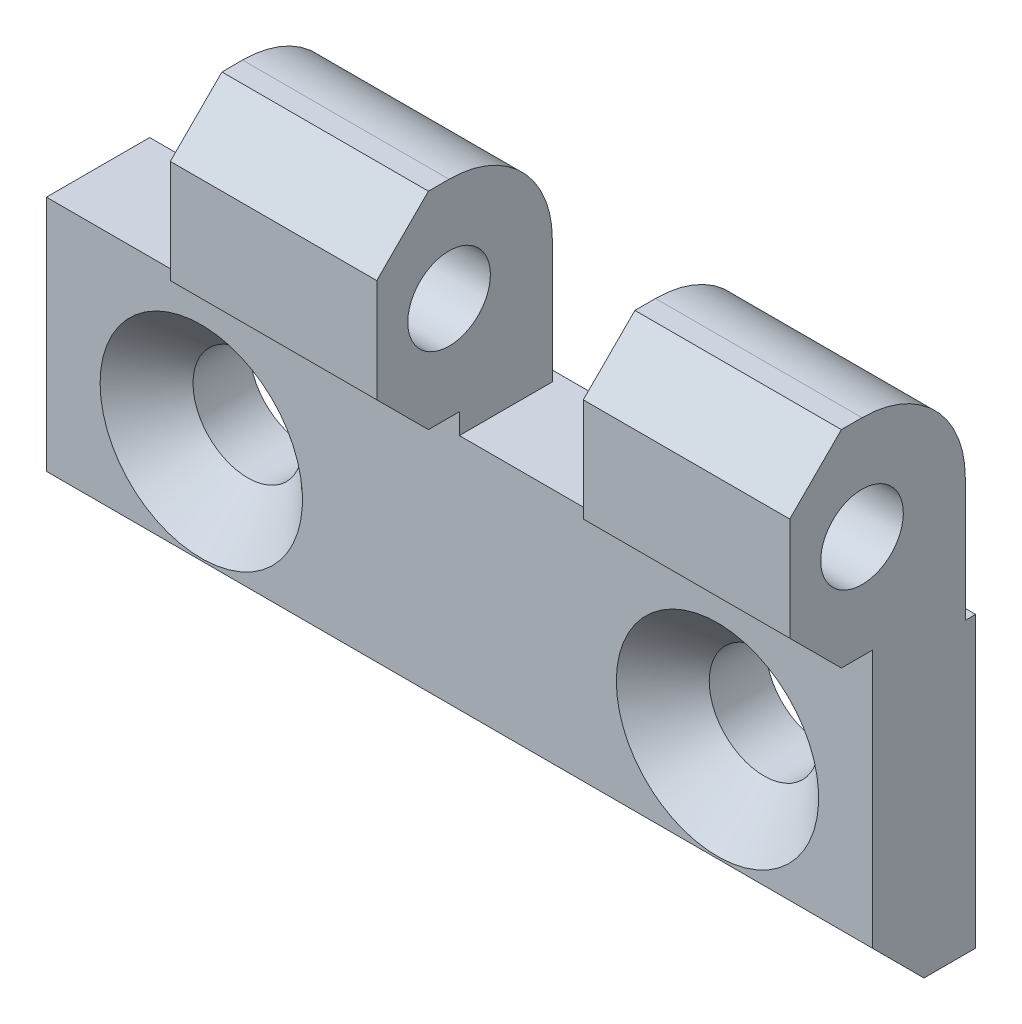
ISO-10303-21;
HEADER;
FILE_DESCRIPTION(('STEP AP214'),'2;1');
FILE_NAME('part.step','',(''),(''),'','','');
FILE_SCHEMA(('AUTOMOTIVE_DESIGN { 1 0 10303 214 1 1 1 1 }'));
ENDSEC;
DATA;
#1=APPLICATION_CONTEXT('core data for automotive mechanical design processes');
#2=APPLICATION_PROTOCOL_DEFINITION('international standard','automotive_design',2000,#1);
#3=PRODUCT_CONTEXT('',#1,'mechanical');
#4=PRODUCT('Part','Part','',(#3));
#5=PRODUCT_RELATED_PRODUCT_CATEGORY('part','',(#4));
#6=PRODUCT_DEFINITION_FORMATION('','',#4);
#7=PRODUCT_DEFINITION_CONTEXT('part definition',#1,'design');
#8=PRODUCT_DEFINITION('design','',#6,#7);
#9=PRODUCT_DEFINITION_SHAPE('','',#8);
#10=(LENGTH_UNIT() NAMED_UNIT(*) SI_UNIT(.MILLI.,.METRE.));
#11=(NAMED_UNIT(*) PLANE_ANGLE_UNIT() SI_UNIT($,.RADIAN.));
#12=(NAMED_UNIT(*) SI_UNIT($,.STERADIAN.) SOLID_ANGLE_UNIT());
#13=UNCERTAINTY_MEASURE_WITH_UNIT(LENGTH_MEASURE(1.E-05),#10,'distance_accuracy_value','');
#14=(GEOMETRIC_REPRESENTATION_CONTEXT(3) GLOBAL_UNCERTAINTY_ASSIGNED_CONTEXT((#13)) GLOBAL_UNIT_ASSIGNED_CONTEXT((#10,
#11,#12)) REPRESENTATION_CONTEXT('',''));
#15=CARTESIAN_POINT('',(0.,0.,0.));
#16=DIRECTION('',(0.,0.,1.));
#17=DIRECTION('',(1.,0.,0.));
#18=AXIS2_PLACEMENT_3D('',#15,#16,#17);
#19=CARTESIAN_POINT('',(-7.5,12.5,5.5));
#20=DIRECTION('',(1.,0.,0.));
#21=DIRECTION('',(0.,1.,0.));
#22=AXIS2_PLACEMENT_3D('',#19,#20,#21);
#23=CYLINDRICAL_SURFACE('',#22,5.);
#24=DIRECTION('',(1.,0.,0.));
#25=VECTOR('',#24,1.);
#26=CARTESIAN_POINT('',(-7.5,12.5,0.5));
#27=LINE('',#26,#25);
#28=CARTESIAN_POINT('',(22.5,12.5,0.5));
#29=VERTEX_POINT('',#28);
#30=CARTESIAN_POINT('',(32.5,12.5,0.5));
#31=VERTEX_POINT('',#30);
#32=EDGE_CURVE('E189',#29,#31,#27,.T.);
#33=ORIENTED_EDGE('',*,*,#32,.F.);
#34=CARTESIAN_POINT('',(22.5,12.5,5.5));
#35=DIRECTION('',(-1.,0.,0.));
#36=DIRECTION('',(0.,-1.,0.));
#37=AXIS2_PLACEMENT_3D('',#34,#35,#36);
#38=CIRCLE('',#37,5.);
#39=CARTESIAN_POINT('',(22.5,17.5,5.5));
#40=VERTEX_POINT('',#39);
#41=EDGE_CURVE('E286',#29,#40,#38,.F.);
#42=ORIENTED_EDGE('',*,*,#41,.T.);
#43=DIRECTION('',(1.,0.,0.));
#44=VECTOR('',#43,1.);
#45=CARTESIAN_POINT('',(-7.5,17.5,5.5));
#46=LINE('',#45,#44);
#47=CARTESIAN_POINT('',(32.5,17.5,5.5));
#48=VERTEX_POINT('',#47);
#49=EDGE_CURVE('E336',#40,#48,#46,.T.);
#50=ORIENTED_EDGE('',*,*,#49,.T.);
#51=CARTESIAN_POINT('',(32.5,12.5,5.5));
#52=DIRECTION('',(1.,0.,0.));
#53=DIRECTION('',(0.,1.,0.));
#54=AXIS2_PLACEMENT_3D('',#51,#52,#53);
#55=CIRCLE('',#54,5.);
#56=EDGE_CURVE('E298',#31,#48,#55,.T.);
#57=ORIENTED_EDGE('',*,*,#56,.F.);
#58=EDGE_LOOP('',(#33,#42,#50,#57));
#59=FACE_BOUND('',#58,.T.);
#60=ADVANCED_FACE('F14',(#59),#23,.T.);
#61=CARTESIAN_POINT('',(12.5,12.5,5.5));
#62=DIRECTION('',(-1.,0.,0.));
#63=DIRECTION('',(0.,-1.,0.));
#64=AXIS2_PLACEMENT_3D('',#61,#62,#63);
#65=CIRCLE('',#64,5.);
#66=CARTESIAN_POINT('',(12.5,12.5,0.5));
#67=VERTEX_POINT('',#66);
#68=CARTESIAN_POINT('',(12.5,17.5,5.5));
#69=VERTEX_POINT('',#68);
#70=EDGE_CURVE('E363',#67,#69,#65,.F.);
#71=ORIENTED_EDGE('',*,*,#70,.F.);
#72=CARTESIAN_POINT('',(2.5,12.5,0.5));
#73=VERTEX_POINT('',#72);
#74=EDGE_CURVE('E192',#73,#67,#27,.T.);
#75=ORIENTED_EDGE('',*,*,#74,.F.);
#76=CARTESIAN_POINT('',(2.5,12.5,5.5));
#77=DIRECTION('',(-1.,0.,0.));
#78=DIRECTION('',(0.,-1.,0.));
#79=AXIS2_PLACEMENT_3D('',#76,#77,#78);
#80=CIRCLE('',#79,5.);
#81=CARTESIAN_POINT('',(2.5,17.5,5.5));
#82=VERTEX_POINT('',#81);
#83=EDGE_CURVE('E169',#73,#82,#80,.F.);
#84=ORIENTED_EDGE('',*,*,#83,.T.);
#85=EDGE_CURVE('E338',#82,#69,#46,.T.);
#86=ORIENTED_EDGE('',*,*,#85,.T.);
#87=EDGE_LOOP('',(#71,#75,#84,#86));
#88=FACE_BOUND('',#87,.T.);
#89=ADVANCED_FACE('F432',(#88),#23,.T.);
#90=CARTESIAN_POINT('',(-7.5,12.5,0.5));
#91=DIRECTION('',(0.,0.,1.));
#92=DIRECTION('',(0.,-1.,0.));
#93=AXIS2_PLACEMENT_3D('',#90,#91,#92);
#94=PLANE('',#93);
#95=DIRECTION('',(0.,-1.,0.));
#96=VECTOR('',#95,1.);
#97=CARTESIAN_POINT('',(22.5,12.5,0.5));
#98=LINE('',#97,#96);
#99=CARTESIAN_POINT('',(22.5,6.5,0.5));
#100=VERTEX_POINT('',#99);
#101=EDGE_CURVE('E289',#29,#100,#98,.T.);
#102=ORIENTED_EDGE('',*,*,#101,.F.);
#103=ORIENTED_EDGE('',*,*,#32,.T.);
#104=DIRECTION('',(0.,-1.,0.));
#105=VECTOR('',#104,1.);
#106=CARTESIAN_POINT('',(32.5,12.5,0.5));
#107=LINE('',#106,#105);
#108=CARTESIAN_POINT('',(32.5,6.5,0.5));
#109=VERTEX_POINT('',#108);
#110=EDGE_CURVE('E321',#31,#109,#107,.T.);
#111=ORIENTED_EDGE('',*,*,#110,.T.);
#112=DIRECTION('',(1.,0.,0.));
#113=VECTOR('',#112,1.);
#114=CARTESIAN_POINT('',(-7.5,6.5,0.5));
#115=LINE('',#114,#113);
#116=EDGE_CURVE('E190',#100,#109,#115,.T.);
#117=ORIENTED_EDGE('',*,*,#116,.F.);
#118=EDGE_LOOP('',(#102,#103,#111,#117));
#119=FACE_BOUND('',#118,.T.);
#120=ADVANCED_FACE('F16',(#119),#94,.F.);
#121=ORIENTED_EDGE('',*,*,#74,.T.);
#122=DIRECTION('',(0.,-1.,0.));
#123=VECTOR('',#122,1.);
#124=CARTESIAN_POINT('',(12.5,12.5,0.5));
#125=LINE('',#124,#123);
#126=CARTESIAN_POINT('',(12.5,6.5,0.5));
#127=VERTEX_POINT('',#126);
#128=EDGE_CURVE('E188',#67,#127,#125,.T.);
#129=ORIENTED_EDGE('',*,*,#128,.T.);
#130=CARTESIAN_POINT('',(2.5,6.5,0.5));
#131=VERTEX_POINT('',#130);
#132=EDGE_CURVE('E180',#131,#127,#115,.T.);
#133=ORIENTED_EDGE('',*,*,#132,.F.);
#134=DIRECTION('',(0.,-1.,0.));
#135=VECTOR('',#134,1.);
#136=CARTESIAN_POINT('',(2.5,12.5,0.5));
#137=LINE('',#136,#135);
#138=EDGE_CURVE('E162',#73,#131,#137,.T.);
#139=ORIENTED_EDGE('',*,*,#138,.F.);
#140=EDGE_LOOP('',(#121,#129,#133,#139));
#141=FACE_BOUND('',#140,.T.);
#142=ADVANCED_FACE('F187',(#141),#94,.F.);
#143=CARTESIAN_POINT('',(-7.5,-7.5,5.));
#144=DIRECTION('',(0.,0.,-1.));
#145=DIRECTION('',(-1.,0.,0.));
#146=AXIS2_PLACEMENT_3D('',#143,#144,#145);
#147=PLANE('',#146);
#148=CARTESIAN_POINT('',(25.,0.,5.));
#149=DIRECTION('',(0.,0.,-1.));
#150=DIRECTION('',(-1.,0.,0.));
#151=AXIS2_PLACEMENT_3D('',#148,#149,#150);
#152=CIRCLE('',#151,4.9);
#153=CARTESIAN_POINT('',(20.1,0.,5.));
#154=VERTEX_POINT('',#153);
#155=EDGE_CURVE('E243',#154,#154,#152,.T.);
#156=ORIENTED_EDGE('',*,*,#155,.T.);
#157=EDGE_LOOP('',(#156));
#158=FACE_BOUND('',#157,.T.);
#159=CARTESIAN_POINT('',(0.,0.,5.));
#160=DIRECTION('',(0.,0.,-1.));
#161=DIRECTION('',(-1.,0.,0.));
#162=AXIS2_PLACEMENT_3D('',#159,#160,#161);
#163=CIRCLE('',#162,4.9);
#164=CARTESIAN_POINT('',(-4.9,0.,5.));
#165=VERTEX_POINT('',#164);
#166=EDGE_CURVE('E235',#165,#165,#163,.T.);
#167=ORIENTED_EDGE('',*,*,#166,.T.);
#168=EDGE_LOOP('',(#167));
#169=FACE_BOUND('',#168,.T.);
#170=DIRECTION('',(0.,1.,0.));
#171=VECTOR('',#170,1.);
#172=CARTESIAN_POINT('',(22.5,-7.5,5.));
#173=LINE('',#172,#171);
#174=CARTESIAN_POINT('',(22.5,6.5,5.));
#175=VERTEX_POINT('',#174);
#176=CARTESIAN_POINT('',(22.5,7.5,5.));
#177=VERTEX_POINT('',#176);
#178=EDGE_CURVE('E268',#175,#177,#173,.T.);
#179=ORIENTED_EDGE('',*,*,#178,.F.);
#180=DIRECTION('',(-1.,0.,0.));
#181=VECTOR('',#180,1.);
#182=CARTESIAN_POINT('',(-7.5,6.5,5.));
#183=LINE('',#182,#181);
#184=CARTESIAN_POINT('',(12.5,6.5,5.));
#185=VERTEX_POINT('',#184);
#186=EDGE_CURVE('E232',#175,#185,#183,.T.);
#187=ORIENTED_EDGE('',*,*,#186,.T.);
#188=DIRECTION('',(0.,1.,0.));
#189=VECTOR('',#188,1.);
#190=CARTESIAN_POINT('',(12.5,-7.5,5.));
#191=LINE('',#190,#189);
#192=CARTESIAN_POINT('',(12.5,7.5,5.));
#193=VERTEX_POINT('',#192);
#194=EDGE_CURVE('E353',#185,#193,#191,.T.);
#195=ORIENTED_EDGE('',*,*,#194,.T.);
#196=DIRECTION('',(1.,0.,0.));
#197=VECTOR('',#196,1.);
#198=CARTESIAN_POINT('',(-7.5,7.5,5.));
#199=LINE('',#198,#197);
#200=CARTESIAN_POINT('',(2.5,7.5,5.));
#201=VERTEX_POINT('',#200);
#202=EDGE_CURVE('E339',#201,#193,#199,.T.);
#203=ORIENTED_EDGE('',*,*,#202,.F.);
#204=DIRECTION('',(0.,1.,0.));
#205=VECTOR('',#204,1.);
#206=CARTESIAN_POINT('',(2.5,-7.5,5.));
#207=LINE('',#206,#205);
#208=CARTESIAN_POINT('',(2.5,6.5,5.));
#209=VERTEX_POINT('',#208);
#210=EDGE_CURVE('E352',#209,#201,#207,.T.);
#211=ORIENTED_EDGE('',*,*,#210,.F.);
#212=DIRECTION('',(-1.,0.,0.));
#213=VECTOR('',#212,1.);
#214=CARTESIAN_POINT('',(-7.5,6.5,5.));
#215=LINE('',#214,#213);
#216=CARTESIAN_POINT('',(-7.5,6.5,5.));
#217=VERTEX_POINT('',#216);
#218=EDGE_CURVE('E182',#209,#217,#215,.T.);
#219=ORIENTED_EDGE('',*,*,#218,.T.);
#220=DIRECTION('',(0.,1.,0.));
#221=VECTOR('',#220,1.);
#222=CARTESIAN_POINT('',(-7.5,-7.5,5.));
#223=LINE('',#222,#221);
#224=CARTESIAN_POINT('',(-7.5,-5.,5.));
#225=VERTEX_POINT('',#224);
#226=EDGE_CURVE('E324',#225,#217,#223,.T.);
#227=ORIENTED_EDGE('',*,*,#226,.F.);
#228=DIRECTION('',(1.,0.,0.));
#229=VECTOR('',#228,1.);
#230=CARTESIAN_POINT('',(-7.5,-5.,5.));
#231=LINE('',#230,#229);
#232=CARTESIAN_POINT('',(32.5,-5.,5.));
#233=VERTEX_POINT('',#232);
#234=EDGE_CURVE('E220',#225,#233,#231,.T.);
#235=ORIENTED_EDGE('',*,*,#234,.T.);
#236=DIRECTION('',(0.,1.,0.));
#237=VECTOR('',#236,1.);
#238=CARTESIAN_POINT('',(32.5,-7.5,5.));
#239=LINE('',#238,#237);
#240=CARTESIAN_POINT('',(32.5,7.5,5.));
#241=VERTEX_POINT('',#240);
#242=EDGE_CURVE('E310',#233,#241,#239,.T.);
#243=ORIENTED_EDGE('',*,*,#242,.T.);
#244=EDGE_CURVE('E271',#177,#241,#199,.T.);
#245=ORIENTED_EDGE('',*,*,#244,.F.);
#246=EDGE_LOOP('',(#179,#187,#195,#203,#211,#219,#227,#235,#243,#245));
#247=FACE_BOUND('',#246,.T.);
#248=ADVANCED_FACE('F259',(#158,#169,#247),#147,.F.);
#249=CARTESIAN_POINT('',(-7.5,7.5,9.));
#250=DIRECTION('',(0.,-1.,0.));
#251=DIRECTION('',(0.,0.,-1.));
#252=AXIS2_PLACEMENT_3D('',#249,#250,#251);
#253=PLANE('',#252);
#254=DIRECTION('',(-1.,0.,0.));
#255=VECTOR('',#254,1.);
#256=CARTESIAN_POINT('',(-7.5,7.5,6.5));
#257=LINE('',#256,#255);
#258=CARTESIAN_POINT('',(32.5,7.5,6.5));
#259=VERTEX_POINT('',#258);
#260=CARTESIAN_POINT('',(22.5,7.5,6.5));
#261=VERTEX_POINT('',#260);
#262=EDGE_CURVE('E217',#259,#261,#257,.T.);
#263=ORIENTED_EDGE('',*,*,#262,.T.);
#264=DIRECTION('',(0.,0.,-1.));
#265=VECTOR('',#264,1.);
#266=CARTESIAN_POINT('',(22.5,7.5,9.));
#267=LINE('',#266,#265);
#268=EDGE_CURVE('E276',#261,#177,#267,.T.);
#269=ORIENTED_EDGE('',*,*,#268,.T.);
#270=ORIENTED_EDGE('',*,*,#244,.T.);
#271=DIRECTION('',(0.,0.,-1.));
#272=VECTOR('',#271,1.);
#273=CARTESIAN_POINT('',(32.5,7.5,9.));
#274=LINE('',#273,#272);
#275=EDGE_CURVE('E307',#259,#241,#274,.T.);
#276=ORIENTED_EDGE('',*,*,#275,.F.);
#277=EDGE_LOOP('',(#263,#269,#270,#276));
#278=FACE_BOUND('',#277,.T.);
#279=ADVANCED_FACE('F262',(#278),#253,.T.);
#280=DIRECTION('',(0.,0.,-1.));
#281=VECTOR('',#280,1.);
#282=CARTESIAN_POINT('',(12.5,7.5,9.));
#283=LINE('',#282,#281);
#284=CARTESIAN_POINT('',(12.5,7.5,6.5));
#285=VERTEX_POINT('',#284);
#286=EDGE_CURVE('E350',#285,#193,#283,.T.);
#287=ORIENTED_EDGE('',*,*,#286,.F.);
#288=CARTESIAN_POINT('',(2.5,7.5,6.5));
#289=VERTEX_POINT('',#288);
#290=EDGE_CURVE('E216',#285,#289,#257,.T.);
#291=ORIENTED_EDGE('',*,*,#290,.T.);
#292=DIRECTION('',(0.,0.,-1.));
#293=VECTOR('',#292,1.);
#294=CARTESIAN_POINT('',(2.5,7.5,9.));
#295=LINE('',#294,#293);
#296=EDGE_CURVE('E37',#289,#201,#295,.T.);
#297=ORIENTED_EDGE('',*,*,#296,.T.);
#298=ORIENTED_EDGE('',*,*,#202,.T.);
#299=EDGE_LOOP('',(#287,#291,#297,#298));
#300=FACE_BOUND('',#299,.T.);
#301=ADVANCED_FACE('F348',(#300),#253,.T.);
#302=CARTESIAN_POINT('',(-7.5,7.5,9.));
#303=DIRECTION('',(0.,0.,-1.));
#304=DIRECTION('',(0.,1.,0.));
#305=AXIS2_PLACEMENT_3D('',#302,#303,#304);
#306=PLANE('',#305);
#307=DIRECTION('',(0.,1.,0.));
#308=VECTOR('',#307,1.);
#309=CARTESIAN_POINT('',(22.5,7.5,9.));
#310=LINE('',#309,#308);
#311=CARTESIAN_POINT('',(22.5,10.,9.));
#312=VERTEX_POINT('',#311);
#313=CARTESIAN_POINT('',(22.5,15.,9.));
#314=VERTEX_POINT('',#313);
#315=EDGE_CURVE('E281',#312,#314,#310,.T.);
#316=ORIENTED_EDGE('',*,*,#315,.F.);
#317=DIRECTION('',(1.,0.,0.));
#318=VECTOR('',#317,1.);
#319=CARTESIAN_POINT('',(32.5,10.,9.));
#320=LINE('',#319,#318);
#321=CARTESIAN_POINT('',(32.5,10.,9.));
#322=VERTEX_POINT('',#321);
#323=EDGE_CURVE('E207',#312,#322,#320,.T.);
#324=ORIENTED_EDGE('',*,*,#323,.T.);
#325=DIRECTION('',(0.,1.,0.));
#326=VECTOR('',#325,1.);
#327=CARTESIAN_POINT('',(32.5,7.5,9.));
#328=LINE('',#327,#326);
#329=CARTESIAN_POINT('',(32.5,15.,9.));
#330=VERTEX_POINT('',#329);
#331=EDGE_CURVE('E304',#322,#330,#328,.T.);
#332=ORIENTED_EDGE('',*,*,#331,.T.);
#333=DIRECTION('',(-1.,0.,0.));
#334=VECTOR('',#333,1.);
#335=CARTESIAN_POINT('',(-7.5,15.,9.));
#336=LINE('',#335,#334);
#337=EDGE_CURVE('E210',#330,#314,#336,.T.);
#338=ORIENTED_EDGE('',*,*,#337,.T.);
#339=EDGE_LOOP('',(#316,#324,#332,#338));
#340=FACE_BOUND('',#339,.T.);
#341=ADVANCED_FACE('F379',(#340),#306,.F.);
#342=CARTESIAN_POINT('',(2.5,10.,9.));
#343=VERTEX_POINT('',#342);
#344=CARTESIAN_POINT('',(12.5,10.,9.));
#345=VERTEX_POINT('',#344);
#346=EDGE_CURVE('E209',#343,#345,#320,.T.);
#347=ORIENTED_EDGE('',*,*,#346,.T.);
#348=DIRECTION('',(0.,1.,0.));
#349=VECTOR('',#348,1.);
#350=CARTESIAN_POINT('',(12.5,7.5,9.));
#351=LINE('',#350,#349);
#352=CARTESIAN_POINT('',(12.5,15.,9.));
#353=VERTEX_POINT('',#352);
#354=EDGE_CURVE('E29',#345,#353,#351,.T.);
#355=ORIENTED_EDGE('',*,*,#354,.T.);
#356=CARTESIAN_POINT('',(2.5,15.,9.));
#357=VERTEX_POINT('',#356);
#358=EDGE_CURVE('E214',#353,#357,#336,.T.);
#359=ORIENTED_EDGE('',*,*,#358,.T.);
#360=DIRECTION('',(0.,1.,0.));
#361=VECTOR('',#360,1.);
#362=CARTESIAN_POINT('',(2.5,7.5,9.));
#363=LINE('',#362,#361);
#364=EDGE_CURVE('E399',#343,#357,#363,.T.);
#365=ORIENTED_EDGE('',*,*,#364,.F.);
#366=EDGE_LOOP('',(#347,#355,#359,#365));
#367=FACE_BOUND('',#366,.T.);
#368=ADVANCED_FACE('F417',(#367),#306,.F.);
#369=CARTESIAN_POINT('',(-7.5,17.5,9.));
#370=DIRECTION('',(0.,-1.,0.));
#371=DIRECTION('',(0.,0.,-1.));
#372=AXIS2_PLACEMENT_3D('',#369,#370,#371);
#373=PLANE('',#372);
#374=DIRECTION('',(0.,0.,-1.));
#375=VECTOR('',#374,1.);
#376=CARTESIAN_POINT('',(22.5,17.5,9.));
#377=LINE('',#376,#375);
#378=CARTESIAN_POINT('',(22.5,17.5,6.5));
#379=VERTEX_POINT('',#378);
#380=EDGE_CURVE('E279',#379,#40,#377,.T.);
#381=ORIENTED_EDGE('',*,*,#380,.F.);
#382=DIRECTION('',(1.,0.,0.));
#383=VECTOR('',#382,1.);
#384=CARTESIAN_POINT('',(-7.5,17.5,6.5));
#385=LINE('',#384,#383);
#386=CARTESIAN_POINT('',(32.5,17.5,6.5));
#387=VERTEX_POINT('',#386);
#388=EDGE_CURVE('E198',#379,#387,#385,.T.);
#389=ORIENTED_EDGE('',*,*,#388,.T.);
#390=DIRECTION('',(0.,0.,-1.));
#391=VECTOR('',#390,1.);
#392=CARTESIAN_POINT('',(32.5,17.5,9.));
#393=LINE('',#392,#391);
#394=EDGE_CURVE('E301',#387,#48,#393,.T.);
#395=ORIENTED_EDGE('',*,*,#394,.T.);
#396=ORIENTED_EDGE('',*,*,#49,.F.);
#397=EDGE_LOOP('',(#381,#389,#395,#396));
#398=FACE_BOUND('',#397,.T.);
#399=ADVANCED_FACE('F390',(#398),#373,.F.);
#400=CARTESIAN_POINT('',(2.5,17.5,6.5));
#401=VERTEX_POINT('',#400);
#402=CARTESIAN_POINT('',(12.5,17.5,6.5));
#403=VERTEX_POINT('',#402);
#404=EDGE_CURVE('E200',#401,#403,#385,.T.);
#405=ORIENTED_EDGE('',*,*,#404,.T.);
#406=DIRECTION('',(0.,0.,-1.));
#407=VECTOR('',#406,1.);
#408=CARTESIAN_POINT('',(12.5,17.5,9.));
#409=LINE('',#408,#407);
#410=EDGE_CURVE('E356',#403,#69,#409,.T.);
#411=ORIENTED_EDGE('',*,*,#410,.T.);
#412=ORIENTED_EDGE('',*,*,#85,.F.);
#413=DIRECTION('',(0.,0.,-1.));
#414=VECTOR('',#413,1.);
#415=CARTESIAN_POINT('',(2.5,17.5,9.));
#416=LINE('',#415,#414);
#417=EDGE_CURVE('E409',#401,#82,#416,.T.);
#418=ORIENTED_EDGE('',*,*,#417,.F.);
#419=EDGE_LOOP('',(#405,#411,#412,#418));
#420=FACE_BOUND('',#419,.T.);
#421=ADVANCED_FACE('F428',(#420),#373,.F.);
#422=CARTESIAN_POINT('',(-7.5,12.5,5.5));
#423=DIRECTION('',(1.,0.,0.));
#424=DIRECTION('',(0.,1.,0.));
#425=AXIS2_PLACEMENT_3D('',#422,#423,#424);
#426=CYLINDRICAL_SURFACE('',#425,2.);
#427=CARTESIAN_POINT('',(32.5,12.5,5.5));
#428=DIRECTION('',(1.,0.,0.));
#429=DIRECTION('',(0.,1.,0.));
#430=AXIS2_PLACEMENT_3D('',#427,#428,#429);
#431=CIRCLE('',#430,2.);
#432=CARTESIAN_POINT('',(32.5,14.5,5.5));
#433=VERTEX_POINT('',#432);
#434=EDGE_CURVE('E295',#433,#433,#431,.T.);
#435=ORIENTED_EDGE('',*,*,#434,.T.);
#436=EDGE_LOOP('',(#435));
#437=FACE_BOUND('',#436,.T.);
#438=CARTESIAN_POINT('',(22.5,12.5,5.5));
#439=DIRECTION('',(-1.,0.,0.));
#440=DIRECTION('',(0.,-1.,0.));
#441=AXIS2_PLACEMENT_3D('',#438,#439,#440);
#442=CIRCLE('',#441,2.);
#443=CARTESIAN_POINT('',(22.5,10.5,5.5));
#444=VERTEX_POINT('',#443);
#445=EDGE_CURVE('E291',#444,#444,#442,.F.);
#446=ORIENTED_EDGE('',*,*,#445,.F.);
#447=EDGE_LOOP('',(#446));
#448=FACE_BOUND('',#447,.T.);
#449=ADVANCED_FACE('F443',(#437,#448),#426,.F.);
#450=CARTESIAN_POINT('',(-7.5,17.5,6.5));
#451=DIRECTION('',(0.,-0.707106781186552,-0.707106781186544));
#452=DIRECTION('',(0.,0.707106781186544,-0.707106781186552));
#453=AXIS2_PLACEMENT_3D('',#450,#451,#452);
#454=PLANE('',#453);
#455=ORIENTED_EDGE('',*,*,#388,.F.);
#456=DIRECTION('',(0.,0.707106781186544,-0.707106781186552));
#457=VECTOR('',#456,1.);
#458=CARTESIAN_POINT('',(22.5,17.5,6.5));
#459=LINE('',#458,#457);
#460=EDGE_CURVE('E275',#379,#314,#459,.F.);
#461=ORIENTED_EDGE('',*,*,#460,.T.);
#462=ORIENTED_EDGE('',*,*,#337,.F.);
#463=DIRECTION('',(0.,0.707106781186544,-0.707106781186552));
#464=VECTOR('',#463,1.);
#465=CARTESIAN_POINT('',(32.5,15.5,8.5));
#466=LINE('',#465,#464);
#467=EDGE_CURVE('E205',#387,#330,#466,.F.);
#468=ORIENTED_EDGE('',*,*,#467,.F.);
#469=EDGE_LOOP('',(#455,#461,#462,#468));
#470=FACE_BOUND('',#469,.T.);
#471=ADVANCED_FACE('F377',(#470),#454,.F.);
#472=DIRECTION('',(0.,0.707106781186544,-0.707106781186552));
#473=VECTOR('',#472,1.);
#474=CARTESIAN_POINT('',(12.5,17.5,6.5));
#475=LINE('',#474,#473);
#476=EDGE_CURVE('E354',#403,#353,#475,.F.);
#477=ORIENTED_EDGE('',*,*,#476,.F.);
#478=ORIENTED_EDGE('',*,*,#404,.F.);
#479=DIRECTION('',(0.,0.707106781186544,-0.707106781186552));
#480=VECTOR('',#479,1.);
#481=CARTESIAN_POINT('',(2.5,17.5,6.5));
#482=LINE('',#481,#480);
#483=EDGE_CURVE('E406',#401,#357,#482,.F.);
#484=ORIENTED_EDGE('',*,*,#483,.T.);
#485=ORIENTED_EDGE('',*,*,#358,.F.);
#486=EDGE_LOOP('',(#477,#478,#484,#485));
#487=FACE_BOUND('',#486,.T.);
#488=ADVANCED_FACE('F422',(#487),#454,.F.);
#489=CARTESIAN_POINT('',(-7.5,10.,9.));
#490=DIRECTION('',(0.,-0.707106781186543,0.707106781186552));
#491=DIRECTION('',(0.,-0.707106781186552,-0.707106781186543));
#492=AXIS2_PLACEMENT_3D('',#489,#490,#491);
#493=PLANE('',#492);
#494=ORIENTED_EDGE('',*,*,#323,.F.);
#495=DIRECTION('',(0.,-0.707106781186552,-0.707106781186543));
#496=VECTOR('',#495,1.);
#497=CARTESIAN_POINT('',(22.5,10.,9.));
#498=LINE('',#497,#496);
#499=EDGE_CURVE('E229',#312,#261,#498,.T.);
#500=ORIENTED_EDGE('',*,*,#499,.T.);
#501=ORIENTED_EDGE('',*,*,#262,.F.);
#502=DIRECTION('',(0.,-0.707106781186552,-0.707106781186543));
#503=VECTOR('',#502,1.);
#504=CARTESIAN_POINT('',(32.5,9.5,8.5));
#505=LINE('',#504,#503);
#506=EDGE_CURVE('E203',#322,#259,#505,.T.);
#507=ORIENTED_EDGE('',*,*,#506,.F.);
#508=EDGE_LOOP('',(#494,#500,#501,#507));
#509=FACE_BOUND('',#508,.T.);
#510=ADVANCED_FACE('F487',(#509),#493,.T.);
#511=DIRECTION('',(0.,-0.707106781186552,-0.707106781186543));
#512=VECTOR('',#511,1.);
#513=CARTESIAN_POINT('',(12.5,10.,9.));
#514=LINE('',#513,#512);
#515=EDGE_CURVE('E227',#345,#285,#514,.T.);
#516=ORIENTED_EDGE('',*,*,#515,.F.);
#517=ORIENTED_EDGE('',*,*,#346,.F.);
#518=DIRECTION('',(0.,-0.707106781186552,-0.707106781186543));
#519=VECTOR('',#518,1.);
#520=CARTESIAN_POINT('',(2.5,10.,9.));
#521=LINE('',#520,#519);
#522=EDGE_CURVE('E225',#343,#289,#521,.T.);
#523=ORIENTED_EDGE('',*,*,#522,.T.);
#524=ORIENTED_EDGE('',*,*,#290,.F.);
#525=EDGE_LOOP('',(#516,#517,#523,#524));
#526=FACE_BOUND('',#525,.T.);
#527=ADVANCED_FACE('F482',(#526),#493,.T.);
#528=CARTESIAN_POINT('',(-7.5,6.5,0.5));
#529=DIRECTION('',(0.,-1.,0.));
#530=DIRECTION('',(0.,0.,-1.));
#531=AXIS2_PLACEMENT_3D('',#528,#529,#530);
#532=PLANE('',#531);
#533=DIRECTION('',(0.,0.,-1.));
#534=VECTOR('',#533,1.);
#535=CARTESIAN_POINT('',(-7.5,6.5,0.5));
#536=LINE('',#535,#534);
#537=CARTESIAN_POINT('',(-7.5,6.5,0.));
#538=VERTEX_POINT('',#537);
#539=EDGE_CURVE('E333',#217,#538,#536,.T.);
#540=ORIENTED_EDGE('',*,*,#539,.F.);
#541=ORIENTED_EDGE('',*,*,#218,.F.);
#542=DIRECTION('',(0.,0.,1.));
#543=VECTOR('',#542,1.);
#544=CARTESIAN_POINT('',(2.5,6.5,-11.));
#545=LINE('',#544,#543);
#546=EDGE_CURVE('E166',#131,#209,#545,.T.);
#547=ORIENTED_EDGE('',*,*,#546,.F.);
#548=ORIENTED_EDGE('',*,*,#132,.T.);
#549=DIRECTION('',(0.,0.,1.));
#550=VECTOR('',#549,1.);
#551=CARTESIAN_POINT('',(12.5,6.5,-11.));
#552=LINE('',#551,#550);
#553=EDGE_CURVE('E183',#127,#185,#552,.T.);
#554=ORIENTED_EDGE('',*,*,#553,.T.);
#555=ORIENTED_EDGE('',*,*,#186,.F.);
#556=DIRECTION('',(0.,0.,1.));
#557=VECTOR('',#556,1.);
#558=CARTESIAN_POINT('',(22.5,6.5,-11.));
#559=LINE('',#558,#557);
#560=EDGE_CURVE('E397',#100,#175,#559,.T.);
#561=ORIENTED_EDGE('',*,*,#560,.F.);
#562=ORIENTED_EDGE('',*,*,#116,.T.);
#563=DIRECTION('',(0.,0.,-1.));
#564=VECTOR('',#563,1.);
#565=CARTESIAN_POINT('',(32.5,6.5,0.5));
#566=LINE('',#565,#564);
#567=CARTESIAN_POINT('',(32.5,6.5,0.));
#568=VERTEX_POINT('',#567);
#569=EDGE_CURVE('E318',#109,#568,#566,.T.);
#570=ORIENTED_EDGE('',*,*,#569,.T.);
#571=DIRECTION('',(1.,0.,0.));
#572=VECTOR('',#571,1.);
#573=CARTESIAN_POINT('',(-7.5,6.5,0.));
#574=LINE('',#573,#572);
#575=EDGE_CURVE('E194',#538,#568,#574,.T.);
#576=ORIENTED_EDGE('',*,*,#575,.F.);
#577=EDGE_LOOP('',(#540,#541,#547,#548,#554,#555,#561,#562,#570,#576));
#578=FACE_BOUND('',#577,.T.);
#579=ADVANCED_FACE('F178',(#578),#532,.F.);
#580=CARTESIAN_POINT('',(-7.5,-7.5,0.));
#581=DIRECTION('',(0.,0.,-1.));
#582=DIRECTION('',(-1.,0.,0.));
#583=AXIS2_PLACEMENT_3D('',#580,#581,#582);
#584=PLANE('',#583);
#585=CARTESIAN_POINT('',(0.,0.,0.));
#586=DIRECTION('',(0.,0.,-1.));
#587=DIRECTION('',(-1.,0.,0.));
#588=AXIS2_PLACEMENT_3D('',#585,#586,#587);
#589=CIRCLE('',#588,2.65);
#590=CARTESIAN_POINT('',(-2.65,0.,0.));
#591=VERTEX_POINT('',#590);
#592=EDGE_CURVE('E238',#591,#591,#589,.T.);
#593=ORIENTED_EDGE('',*,*,#592,.F.);
#594=EDGE_LOOP('',(#593));
#595=FACE_BOUND('',#594,.T.);
#596=CARTESIAN_POINT('',(25.,0.,0.));
#597=DIRECTION('',(0.,0.,-1.));
#598=DIRECTION('',(-1.,0.,0.));
#599=AXIS2_PLACEMENT_3D('',#596,#597,#598);
#600=CIRCLE('',#599,2.65);
#601=CARTESIAN_POINT('',(22.35,0.,0.));
#602=VERTEX_POINT('',#601);
#603=EDGE_CURVE('E184',#602,#602,#600,.T.);
#604=ORIENTED_EDGE('',*,*,#603,.F.);
#605=EDGE_LOOP('',(#604));
#606=FACE_BOUND('',#605,.T.);
#607=DIRECTION('',(1.,0.,0.));
#608=VECTOR('',#607,1.);
#609=CARTESIAN_POINT('',(-7.5,-7.5,0.));
#610=LINE('',#609,#608);
#611=CARTESIAN_POINT('',(-7.5,-7.5,0.));
#612=VERTEX_POINT('',#611);
#613=CARTESIAN_POINT('',(32.5,-7.5,0.));
#614=VERTEX_POINT('',#613);
#615=EDGE_CURVE('E340',#612,#614,#610,.T.);
#616=ORIENTED_EDGE('',*,*,#615,.F.);
#617=DIRECTION('',(0.,1.,0.));
#618=VECTOR('',#617,1.);
#619=CARTESIAN_POINT('',(-7.5,-7.5,0.));
#620=LINE('',#619,#618);
#621=EDGE_CURVE('E330',#612,#538,#620,.T.);
#622=ORIENTED_EDGE('',*,*,#621,.T.);
#623=ORIENTED_EDGE('',*,*,#575,.T.);
#624=DIRECTION('',(0.,1.,0.));
#625=VECTOR('',#624,1.);
#626=CARTESIAN_POINT('',(32.5,-7.5,0.));
#627=LINE('',#626,#625);
#628=EDGE_CURVE('E315',#614,#568,#627,.T.);
#629=ORIENTED_EDGE('',*,*,#628,.F.);
#630=EDGE_LOOP('',(#616,#622,#623,#629));
#631=FACE_BOUND('',#630,.T.);
#632=ADVANCED_FACE('F478',(#595,#606,#631),#584,.T.);
#633=CARTESIAN_POINT('',(-7.5,-7.5,0.));
#634=DIRECTION('',(0.,1.,0.));
#635=DIRECTION('',(0.,0.,1.));
#636=AXIS2_PLACEMENT_3D('',#633,#634,#635);
#637=PLANE('',#636);
#638=DIRECTION('',(0.,0.,1.));
#639=VECTOR('',#638,1.);
#640=CARTESIAN_POINT('',(32.5,-7.5,0.));
#641=LINE('',#640,#639);
#642=CARTESIAN_POINT('',(32.5,-7.5,2.5));
#643=VERTEX_POINT('',#642);
#644=EDGE_CURVE('E312',#614,#643,#641,.T.);
#645=ORIENTED_EDGE('',*,*,#644,.T.);
#646=DIRECTION('',(-1.,0.,0.));
#647=VECTOR('',#646,1.);
#648=CARTESIAN_POINT('',(-7.5,-7.5,2.5));
#649=LINE('',#648,#647);
#650=CARTESIAN_POINT('',(-7.5,-7.5,2.5));
#651=VERTEX_POINT('',#650);
#652=EDGE_CURVE('E223',#643,#651,#649,.T.);
#653=ORIENTED_EDGE('',*,*,#652,.T.);
#654=DIRECTION('',(0.,0.,1.));
#655=VECTOR('',#654,1.);
#656=CARTESIAN_POINT('',(-7.5,-7.5,0.));
#657=LINE('',#656,#655);
#658=EDGE_CURVE('E327',#612,#651,#657,.T.);
#659=ORIENTED_EDGE('',*,*,#658,.F.);
#660=ORIENTED_EDGE('',*,*,#615,.T.);
#661=EDGE_LOOP('',(#645,#653,#659,#660));
#662=FACE_BOUND('',#661,.T.);
#663=ADVANCED_FACE('F475',(#662),#637,.F.);
#664=CARTESIAN_POINT('',(-7.5,12.5,5.5));
#665=DIRECTION('',(1.,0.,0.));
#666=DIRECTION('',(0.,1.,0.));
#667=AXIS2_PLACEMENT_3D('',#664,#665,#666);
#668=PLANE('',#667);
#669=ORIENTED_EDGE('',*,*,#226,.T.);
#670=ORIENTED_EDGE('',*,*,#539,.T.);
#671=ORIENTED_EDGE('',*,*,#621,.F.);
#672=ORIENTED_EDGE('',*,*,#658,.T.);
#673=DIRECTION('',(0.,-0.707106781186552,-0.707106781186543));
#674=VECTOR('',#673,1.);
#675=CARTESIAN_POINT('',(-7.5,-5.,5.));
#676=LINE('',#675,#674);
#677=EDGE_CURVE('E213',#651,#225,#676,.F.);
#678=ORIENTED_EDGE('',*,*,#677,.T.);
#679=EDGE_LOOP('',(#669,#670,#671,#672,#678));
#680=FACE_BOUND('',#679,.T.);
#681=ADVANCED_FACE('F466',(#680),#668,.F.);
#682=CARTESIAN_POINT('',(32.5,12.5,5.5));
#683=DIRECTION('',(1.,0.,0.));
#684=DIRECTION('',(0.,1.,0.));
#685=AXIS2_PLACEMENT_3D('',#682,#683,#684);
#686=PLANE('',#685);
#687=ORIENTED_EDGE('',*,*,#434,.F.);
#688=EDGE_LOOP('',(#687));
#689=FACE_BOUND('',#688,.T.);
#690=ORIENTED_EDGE('',*,*,#394,.F.);
#691=ORIENTED_EDGE('',*,*,#467,.T.);
#692=ORIENTED_EDGE('',*,*,#331,.F.);
#693=ORIENTED_EDGE('',*,*,#506,.T.);
#694=ORIENTED_EDGE('',*,*,#275,.T.);
#695=ORIENTED_EDGE('',*,*,#242,.F.);
#696=DIRECTION('',(0.,0.707106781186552,0.707106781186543));
#697=VECTOR('',#696,1.);
#698=CARTESIAN_POINT('',(32.5,4.00000000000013,14.));
#699=LINE('',#698,#697);
#700=EDGE_CURVE('E201',#233,#643,#699,.F.);
#701=ORIENTED_EDGE('',*,*,#700,.T.);
#702=ORIENTED_EDGE('',*,*,#644,.F.);
#703=ORIENTED_EDGE('',*,*,#628,.T.);
#704=ORIENTED_EDGE('',*,*,#569,.F.);
#705=ORIENTED_EDGE('',*,*,#110,.F.);
#706=ORIENTED_EDGE('',*,*,#56,.T.);
#707=EDGE_LOOP('',(#690,#691,#692,#693,#694,#695,#701,#702,#703,#704,#705,#706));
#708=FACE_BOUND('',#707,.T.);
#709=ADVANCED_FACE('F384',(#689,#708),#686,.T.);
#710=CARTESIAN_POINT('',(-7.5,-5.,5.));
#711=DIRECTION('',(0.,0.707106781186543,-0.707106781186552));
#712=DIRECTION('',(0.,0.707106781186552,0.707106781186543));
#713=AXIS2_PLACEMENT_3D('',#710,#711,#712);
#714=PLANE('',#713);
#715=ORIENTED_EDGE('',*,*,#677,.F.);
#716=ORIENTED_EDGE('',*,*,#652,.F.);
#717=ORIENTED_EDGE('',*,*,#700,.F.);
#718=ORIENTED_EDGE('',*,*,#234,.F.);
#719=EDGE_LOOP('',(#715,#716,#717,#718));
#720=FACE_BOUND('',#719,.T.);
#721=ADVANCED_FACE('F446',(#720),#714,.F.);
#722=CARTESIAN_POINT('',(2.5,32.5,-11.));
#723=DIRECTION('',(-1.,0.,0.));
#724=DIRECTION('',(0.,-1.,0.));
#725=AXIS2_PLACEMENT_3D('',#722,#723,#724);
#726=PLANE('',#725);
#727=ORIENTED_EDGE('',*,*,#138,.T.);
#728=ORIENTED_EDGE('',*,*,#546,.T.);
#729=ORIENTED_EDGE('',*,*,#210,.T.);
#730=ORIENTED_EDGE('',*,*,#296,.F.);
#731=ORIENTED_EDGE('',*,*,#522,.F.);
#732=ORIENTED_EDGE('',*,*,#364,.T.);
#733=ORIENTED_EDGE('',*,*,#483,.F.);
#734=ORIENTED_EDGE('',*,*,#417,.T.);
#735=ORIENTED_EDGE('',*,*,#83,.F.);
#736=EDGE_LOOP('',(#727,#728,#729,#730,#731,#732,#733,#734,#735));
#737=FACE_BOUND('',#736,.T.);
#738=CARTESIAN_POINT('',(2.5,12.5,5.5));
#739=DIRECTION('',(-1.,0.,0.));
#740=DIRECTION('',(0.,-1.,0.));
#741=AXIS2_PLACEMENT_3D('',#738,#739,#740);
#742=CIRCLE('',#741,2.);
#743=CARTESIAN_POINT('',(2.5,10.5,5.5));
#744=VERTEX_POINT('',#743);
#745=EDGE_CURVE('E174',#744,#744,#742,.F.);
#746=ORIENTED_EDGE('',*,*,#745,.T.);
#747=EDGE_LOOP('',(#746));
#748=FACE_BOUND('',#747,.T.);
#749=ADVANCED_FACE('F164',(#737,#748),#726,.T.);
#750=CARTESIAN_POINT('',(22.5,32.5,-11.));
#751=DIRECTION('',(-1.,0.,0.));
#752=DIRECTION('',(0.,-1.,0.));
#753=AXIS2_PLACEMENT_3D('',#750,#751,#752);
#754=PLANE('',#753);
#755=ORIENTED_EDGE('',*,*,#101,.T.);
#756=ORIENTED_EDGE('',*,*,#560,.T.);
#757=ORIENTED_EDGE('',*,*,#178,.T.);
#758=ORIENTED_EDGE('',*,*,#268,.F.);
#759=ORIENTED_EDGE('',*,*,#499,.F.);
#760=ORIENTED_EDGE('',*,*,#315,.T.);
#761=ORIENTED_EDGE('',*,*,#460,.F.);
#762=ORIENTED_EDGE('',*,*,#380,.T.);
#763=ORIENTED_EDGE('',*,*,#41,.F.);
#764=EDGE_LOOP('',(#755,#756,#757,#758,#759,#760,#761,#762,#763));
#765=FACE_BOUND('',#764,.T.);
#766=ORIENTED_EDGE('',*,*,#445,.T.);
#767=EDGE_LOOP('',(#766));
#768=FACE_BOUND('',#767,.T.);
#769=ADVANCED_FACE('F369',(#765,#768),#754,.T.);
#770=CARTESIAN_POINT('',(12.5,32.5,-11.));
#771=DIRECTION('',(-1.,0.,0.));
#772=DIRECTION('',(0.,-1.,0.));
#773=AXIS2_PLACEMENT_3D('',#770,#771,#772);
#774=PLANE('',#773);
#775=ORIENTED_EDGE('',*,*,#70,.T.);
#776=ORIENTED_EDGE('',*,*,#410,.F.);
#777=ORIENTED_EDGE('',*,*,#476,.T.);
#778=ORIENTED_EDGE('',*,*,#354,.F.);
#779=ORIENTED_EDGE('',*,*,#515,.T.);
#780=ORIENTED_EDGE('',*,*,#286,.T.);
#781=ORIENTED_EDGE('',*,*,#194,.F.);
#782=ORIENTED_EDGE('',*,*,#553,.F.);
#783=ORIENTED_EDGE('',*,*,#128,.F.);
#784=EDGE_LOOP('',(#775,#776,#777,#778,#779,#780,#781,#782,#783));
#785=FACE_BOUND('',#784,.T.);
#786=CARTESIAN_POINT('',(12.5,12.5,5.5));
#787=DIRECTION('',(-1.,0.,0.));
#788=DIRECTION('',(0.,-1.,0.));
#789=AXIS2_PLACEMENT_3D('',#786,#787,#788);
#790=CIRCLE('',#789,2.);
#791=CARTESIAN_POINT('',(12.5,10.5,5.5));
#792=VERTEX_POINT('',#791);
#793=EDGE_CURVE('E366',#792,#792,#790,.F.);
#794=ORIENTED_EDGE('',*,*,#793,.F.);
#795=EDGE_LOOP('',(#794));
#796=FACE_BOUND('',#795,.T.);
#797=ADVANCED_FACE('F433',(#785,#796),#774,.F.);
#798=ORIENTED_EDGE('',*,*,#793,.T.);
#799=EDGE_LOOP('',(#798));
#800=FACE_BOUND('',#799,.T.);
#801=ORIENTED_EDGE('',*,*,#745,.F.);
#802=EDGE_LOOP('',(#801));
#803=FACE_BOUND('',#802,.T.);
#804=ADVANCED_FACE('F436',(#800,#803),#426,.F.);
#805=CARTESIAN_POINT('',(25.,0.,5.));
#806=DIRECTION('',(0.,0.,-1.));
#807=DIRECTION('',(-1.,0.,0.));
#808=AXIS2_PLACEMENT_3D('',#805,#806,#807);
#809=CYLINDRICAL_SURFACE('',#808,2.65);
#810=CARTESIAN_POINT('',(25.,0.,2.75));
#811=DIRECTION('',(0.,0.,-1.));
#812=DIRECTION('',(-1.,0.,0.));
#813=AXIS2_PLACEMENT_3D('',#810,#811,#812);
#814=CIRCLE('',#813,2.65);
#815=CARTESIAN_POINT('',(22.35,0.,2.75));
#816=VERTEX_POINT('',#815);
#817=EDGE_CURVE('E22',#816,#816,#814,.F.);
#818=ORIENTED_EDGE('',*,*,#817,.T.);
#819=EDGE_LOOP('',(#818));
#820=FACE_BOUND('',#819,.T.);
#821=ORIENTED_EDGE('',*,*,#603,.T.);
#822=EDGE_LOOP('',(#821));
#823=FACE_BOUND('',#822,.T.);
#824=ADVANCED_FACE('F248',(#820,#823),#809,.F.);
#825=CARTESIAN_POINT('',(0.,0.,5.));
#826=DIRECTION('',(0.,0.,-1.));
#827=DIRECTION('',(-1.,0.,0.));
#828=AXIS2_PLACEMENT_3D('',#825,#826,#827);
#829=CYLINDRICAL_SURFACE('',#828,2.65);
#830=CARTESIAN_POINT('',(0.,0.,2.75));
#831=DIRECTION('',(0.,0.,-1.));
#832=DIRECTION('',(-1.,0.,0.));
#833=AXIS2_PLACEMENT_3D('',#830,#831,#832);
#834=CIRCLE('',#833,2.65);
#835=CARTESIAN_POINT('',(-2.65,0.,2.75));
#836=VERTEX_POINT('',#835);
#837=EDGE_CURVE('E9',#836,#836,#834,.F.);
#838=ORIENTED_EDGE('',*,*,#837,.T.);
#839=EDGE_LOOP('',(#838));
#840=FACE_BOUND('',#839,.T.);
#841=ORIENTED_EDGE('',*,*,#592,.T.);
#842=EDGE_LOOP('',(#841));
#843=FACE_BOUND('',#842,.T.);
#844=ADVANCED_FACE('F255',(#840,#843),#829,.F.);
#845=CARTESIAN_POINT('',(25.,0.,5.));
#846=DIRECTION('',(0.,0.,1.));
#847=DIRECTION('',(1.,0.,0.));
#848=AXIS2_PLACEMENT_3D('',#845,#846,#847);
#849=CONICAL_SURFACE('',#848,4.9,0.785398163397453);
#850=ORIENTED_EDGE('',*,*,#817,.F.);
#851=EDGE_LOOP('',(#850));
#852=FACE_BOUND('',#851,.T.);
#853=ORIENTED_EDGE('',*,*,#155,.F.);
#854=EDGE_LOOP('',(#853));
#855=FACE_BOUND('',#854,.T.);
#856=ADVANCED_FACE('F251',(#852,#855),#849,.F.);
#857=CARTESIAN_POINT('',(0.,0.,5.));
#858=DIRECTION('',(0.,0.,1.));
#859=DIRECTION('',(1.,0.,0.));
#860=AXIS2_PLACEMENT_3D('',#857,#858,#859);
#861=CONICAL_SURFACE('',#860,4.9,0.785398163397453);
#862=ORIENTED_EDGE('',*,*,#837,.F.);
#863=EDGE_LOOP('',(#862));
#864=FACE_BOUND('',#863,.T.);
#865=ORIENTED_EDGE('',*,*,#166,.F.);
#866=EDGE_LOOP('',(#865));
#867=FACE_BOUND('',#866,.T.);
#868=ADVANCED_FACE('F254',(#864,#867),#861,.F.);
#869=CLOSED_SHELL('',(#60,#89,#120,#142,#248,#279,#301,#341,#368,#399,#421,#449,#471,#488,#510,
#527,#579,#632,#663,#681,#709,#721,#749,#769,#797,#804,#824,#844,#856,#868));
#870=MANIFOLD_SOLID_BREP('B1',#869);
#871=ADVANCED_BREP_SHAPE_REPRESENTATION('',(#18,#870),#14);
#872=SHAPE_DEFINITION_REPRESENTATION(#9,#871);
ENDSEC;
END-ISO-10303-21;
